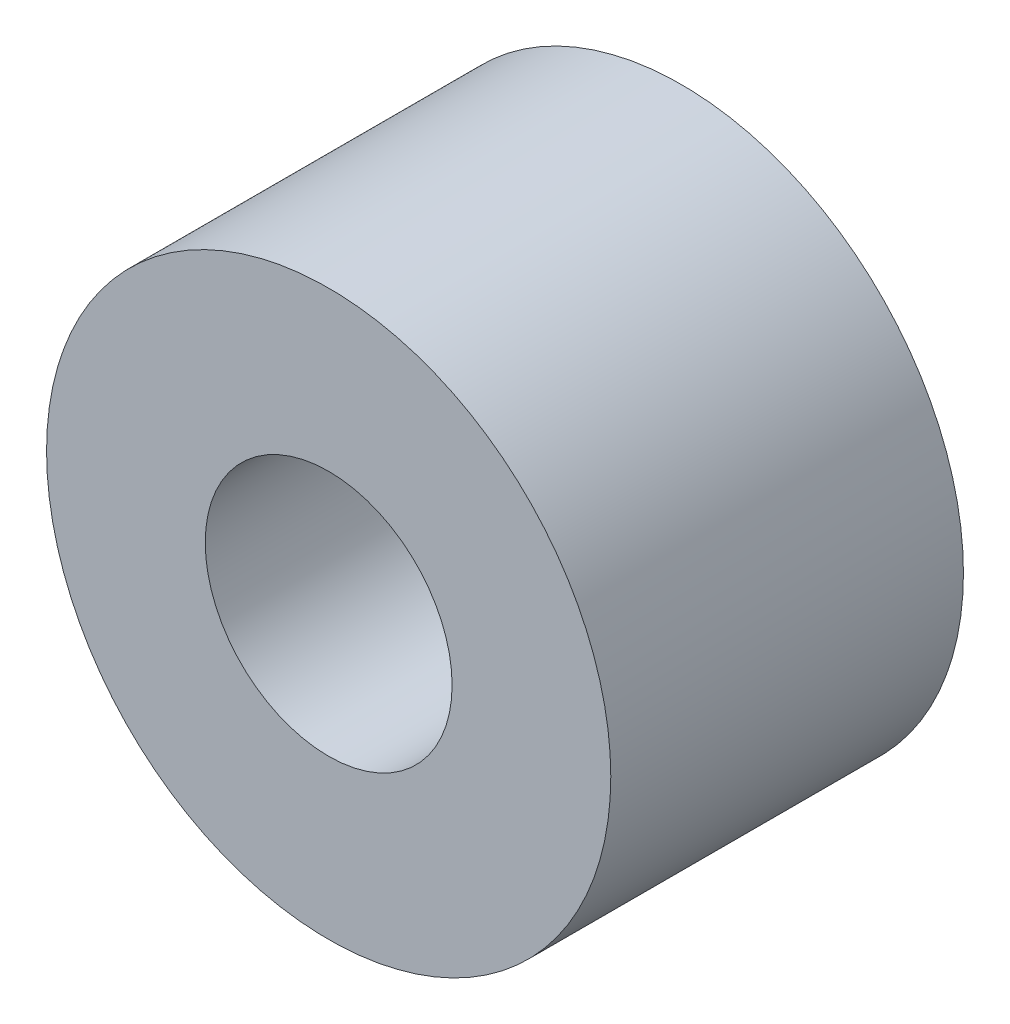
from build123d import *

# Parameters (mm, degrees)
BODYFV_W   = 4
BODYFV_H   = 5
THRUHLFV_W = 1.75
THRUHLFV_H = 5


with BuildPart() as part:
    # BodyFV → Revolve1 (revolve)
    with BuildSketch(Plane(origin=(0, 0, 0), x_dir=(1, 0, 0), z_dir=(0, 1, 0)), mode=Mode.PRIVATE) as revolve1_sk:
        with Locations((2, 2.5)):
            Rectangle(BODYFV_W, BODYFV_H)
    revolve(revolve1_sk.sketch.rotate(Axis((0, 0, 0), (0, 0, 1)), 180), axis=Axis((0, 0, 0), (0, 0, 1)))

    # ThruHlFV → Thru Hole (revolve, cut)
    with BuildSketch(Plane(origin=(0, 0, 0), x_dir=(1, 0, 0), z_dir=(0, 1, 0)), mode=Mode.PRIVATE) as thru_hole_sk:
        with Locations((0.875, 2.5)):
            Rectangle(THRUHLFV_W, THRUHLFV_H)
    revolve(thru_hole_sk.sketch.rotate(Axis((0, 0, 0), (0, 0, 1)), 180), axis=Axis((0, 0, 0), (0, 0, 1)), mode=Mode.SUBTRACT)


solid = part.part
